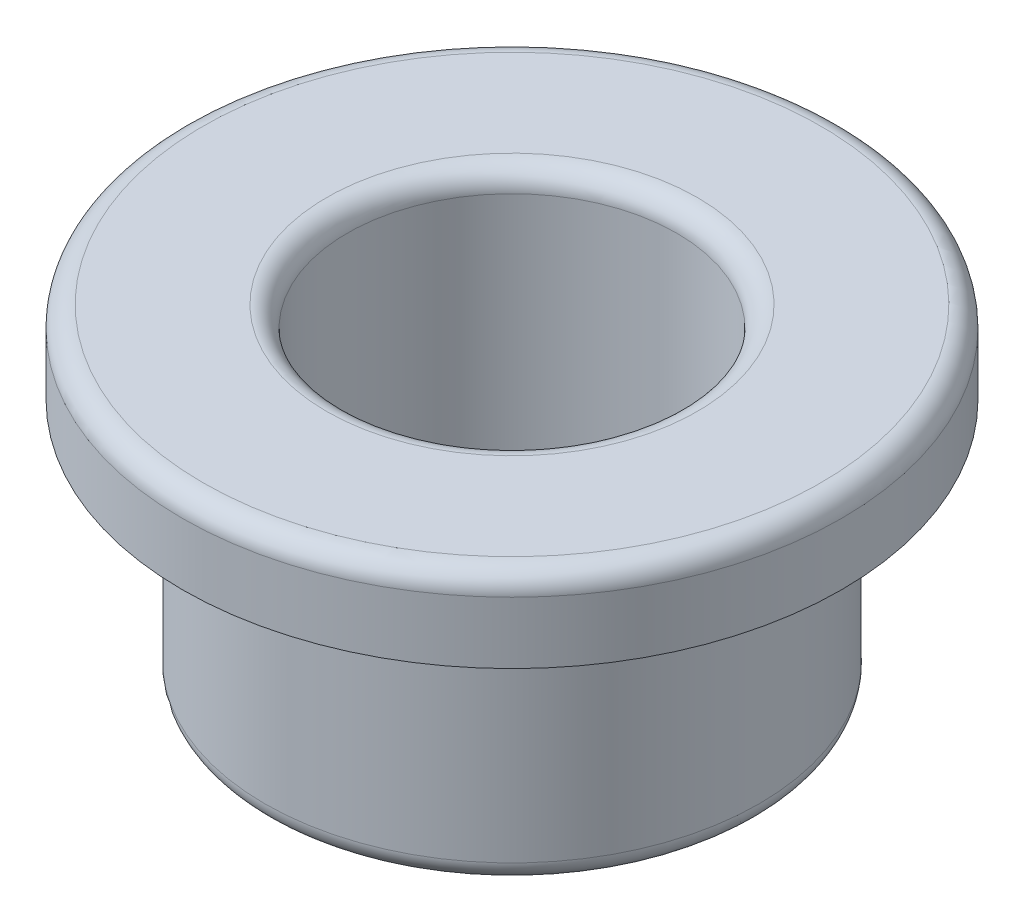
ISO-10303-21;
HEADER;
FILE_DESCRIPTION(('STEP AP214'),'2;1');
FILE_NAME('part.step','',(''),(''),'','','');
FILE_SCHEMA(('AUTOMOTIVE_DESIGN { 1 0 10303 214 1 1 1 1 }'));
ENDSEC;
DATA;
#1=APPLICATION_CONTEXT('core data for automotive mechanical design processes');
#2=APPLICATION_PROTOCOL_DEFINITION('international standard','automotive_design',2000,#1);
#3=PRODUCT_CONTEXT('',#1,'mechanical');
#4=PRODUCT('Part','Part','',(#3));
#5=PRODUCT_RELATED_PRODUCT_CATEGORY('part','',(#4));
#6=PRODUCT_DEFINITION_FORMATION('','',#4);
#7=PRODUCT_DEFINITION_CONTEXT('part definition',#1,'design');
#8=PRODUCT_DEFINITION('design','',#6,#7);
#9=PRODUCT_DEFINITION_SHAPE('','',#8);
#10=(LENGTH_UNIT() NAMED_UNIT(*) SI_UNIT(.MILLI.,.METRE.));
#11=(NAMED_UNIT(*) PLANE_ANGLE_UNIT() SI_UNIT($,.RADIAN.));
#12=(NAMED_UNIT(*) SI_UNIT($,.STERADIAN.) SOLID_ANGLE_UNIT());
#13=UNCERTAINTY_MEASURE_WITH_UNIT(LENGTH_MEASURE(1.E-05),#10,'distance_accuracy_value','');
#14=(GEOMETRIC_REPRESENTATION_CONTEXT(3) GLOBAL_UNCERTAINTY_ASSIGNED_CONTEXT((#13)) GLOBAL_UNIT_ASSIGNED_CONTEXT((#10,
#11,#12)) REPRESENTATION_CONTEXT('',''));
#15=CARTESIAN_POINT('',(0.,0.,0.));
#16=DIRECTION('',(0.,0.,1.));
#17=DIRECTION('',(1.,0.,0.));
#18=AXIS2_PLACEMENT_3D('',#15,#16,#17);
#19=CARTESIAN_POINT('',(0.,0.,0.));
#20=DIRECTION('',(0.,-1.00000000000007,0.));
#21=DIRECTION('',(0.,0.,-1.));
#22=AXIS2_PLACEMENT_3D('',#19,#20,#21);
#23=CYLINDRICAL_SURFACE('',#22,4.);
#24=CARTESIAN_POINT('',(0.,7.50000000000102,0.));
#25=DIRECTION('',(0.,1.00000000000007,0.));
#26=DIRECTION('',(0.,0.,1.));
#27=AXIS2_PLACEMENT_3D('',#24,#25,#26);
#28=CIRCLE('',#27,4.);
#29=CARTESIAN_POINT('',(0.,7.50000000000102,4.));
#30=VERTEX_POINT('',#29);
#31=EDGE_CURVE('E48',#30,#30,#28,.T.);
#32=ORIENTED_EDGE('',*,*,#31,.T.);
#33=EDGE_LOOP('',(#32));
#34=FACE_BOUND('',#33,.T.);
#35=CARTESIAN_POINT('',(0.,0.5,0.));
#36=DIRECTION('',(0.,-1.00000000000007,0.));
#37=DIRECTION('',(0.,0.,-1.));
#38=AXIS2_PLACEMENT_3D('',#35,#36,#37);
#39=CIRCLE('',#38,4.);
#40=CARTESIAN_POINT('',(0.,0.5,-4.));
#41=VERTEX_POINT('',#40);
#42=EDGE_CURVE('E51',#41,#41,#39,.T.);
#43=ORIENTED_EDGE('',*,*,#42,.T.);
#44=EDGE_LOOP('',(#43));
#45=FACE_BOUND('',#44,.T.);
#46=ADVANCED_FACE('F26',(#34,#45),#23,.F.);
#47=CARTESIAN_POINT('',(4.,8.00000000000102,0.));
#48=DIRECTION('',(0.,1.00000000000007,0.));
#49=DIRECTION('',(0.,0.,1.));
#50=AXIS2_PLACEMENT_3D('',#47,#48,#49);
#51=PLANE('',#50);
#52=CARTESIAN_POINT('',(0.,8.00000000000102,0.));
#53=DIRECTION('',(0.,1.00000000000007,0.));
#54=DIRECTION('',(0.,0.,1.));
#55=AXIS2_PLACEMENT_3D('',#52,#53,#54);
#56=CIRCLE('',#55,7.5);
#57=CARTESIAN_POINT('',(0.,8.00000000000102,7.5));
#58=VERTEX_POINT('',#57);
#59=EDGE_CURVE('E54',#58,#58,#56,.T.);
#60=ORIENTED_EDGE('',*,*,#59,.T.);
#61=EDGE_LOOP('',(#60));
#62=FACE_BOUND('',#61,.T.);
#63=CARTESIAN_POINT('',(0.,8.00000000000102,0.));
#64=DIRECTION('',(0.,1.00000000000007,0.));
#65=DIRECTION('',(0.,0.,1.));
#66=AXIS2_PLACEMENT_3D('',#63,#64,#65);
#67=CIRCLE('',#66,4.5);
#68=CARTESIAN_POINT('',(0.,8.00000000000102,4.5));
#69=VERTEX_POINT('',#68);
#70=EDGE_CURVE('E57',#69,#69,#67,.F.);
#71=ORIENTED_EDGE('',*,*,#70,.T.);
#72=EDGE_LOOP('',(#71));
#73=FACE_BOUND('',#72,.T.);
#74=ADVANCED_FACE('F71',(#62,#73),#51,.T.);
#75=CARTESIAN_POINT('',(0.,0.,0.));
#76=DIRECTION('',(0.,-1.00000000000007,0.));
#77=DIRECTION('',(0.,0.,-1.));
#78=AXIS2_PLACEMENT_3D('',#75,#76,#77);
#79=CYLINDRICAL_SURFACE('',#78,8.);
#80=CARTESIAN_POINT('',(0.,7.50000000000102,0.));
#81=DIRECTION('',(0.,1.00000000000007,0.));
#82=DIRECTION('',(0.,0.,1.));
#83=AXIS2_PLACEMENT_3D('',#80,#81,#82);
#84=CIRCLE('',#83,8.);
#85=CARTESIAN_POINT('',(0.,7.50000000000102,8.));
#86=VERTEX_POINT('',#85);
#87=EDGE_CURVE('E60',#86,#86,#84,.F.);
#88=ORIENTED_EDGE('',*,*,#87,.T.);
#89=EDGE_LOOP('',(#88));
#90=FACE_BOUND('',#89,.T.);
#91=CARTESIAN_POINT('',(0.,6.,0.));
#92=DIRECTION('',(0.,-1.00000000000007,0.));
#93=DIRECTION('',(0.,0.,-1.));
#94=AXIS2_PLACEMENT_3D('',#91,#92,#93);
#95=CIRCLE('',#94,8.);
#96=CARTESIAN_POINT('',(0.,6.,-8.));
#97=VERTEX_POINT('',#96);
#98=EDGE_CURVE('E63',#97,#97,#95,.T.);
#99=ORIENTED_EDGE('',*,*,#98,.F.);
#100=EDGE_LOOP('',(#99));
#101=FACE_BOUND('',#100,.T.);
#102=ADVANCED_FACE('F69',(#90,#101),#79,.T.);
#103=CARTESIAN_POINT('',(5.9999999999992,6.00000000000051,5.29090660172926E-13));
#104=DIRECTION('',(0.,-1.00000000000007,0.));
#105=DIRECTION('',(0.,0.,-1.));
#106=AXIS2_PLACEMENT_3D('',#103,#104,#105);
#107=PLANE('',#106);
#108=CARTESIAN_POINT('',(0.,6.,0.));
#109=DIRECTION('',(0.,-1.00000000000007,0.));
#110=DIRECTION('',(0.,0.,-1.));
#111=AXIS2_PLACEMENT_3D('',#108,#109,#110);
#112=CIRCLE('',#111,6.5);
#113=CARTESIAN_POINT('',(0.,6.,-6.5));
#114=VERTEX_POINT('',#113);
#115=EDGE_CURVE('E10',#114,#114,#112,.F.);
#116=ORIENTED_EDGE('',*,*,#115,.T.);
#117=EDGE_LOOP('',(#116));
#118=FACE_BOUND('',#117,.T.);
#119=ORIENTED_EDGE('',*,*,#98,.T.);
#120=EDGE_LOOP('',(#119));
#121=FACE_BOUND('',#120,.T.);
#122=ADVANCED_FACE('F67',(#118,#121),#107,.T.);
#123=CARTESIAN_POINT('',(0.,0.,0.));
#124=DIRECTION('',(0.,-1.00000000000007,0.));
#125=DIRECTION('',(0.,0.,-1.));
#126=AXIS2_PLACEMENT_3D('',#123,#124,#125);
#127=CYLINDRICAL_SURFACE('',#126,6.);
#128=CARTESIAN_POINT('',(0.,0.5,0.));
#129=DIRECTION('',(0.,-1.00000000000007,0.));
#130=DIRECTION('',(0.,0.,-1.));
#131=AXIS2_PLACEMENT_3D('',#128,#129,#130);
#132=CIRCLE('',#131,6.);
#133=CARTESIAN_POINT('',(0.,0.499999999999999,-6.));
#134=VERTEX_POINT('',#133);
#135=EDGE_CURVE('E32',#134,#134,#132,.F.);
#136=ORIENTED_EDGE('',*,*,#135,.T.);
#137=EDGE_LOOP('',(#136));
#138=FACE_BOUND('',#137,.T.);
#139=CARTESIAN_POINT('',(0.,5.5,0.));
#140=DIRECTION('',(0.,-1.00000000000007,0.));
#141=DIRECTION('',(0.,0.,-1.));
#142=AXIS2_PLACEMENT_3D('',#139,#140,#141);
#143=CIRCLE('',#142,6.);
#144=CARTESIAN_POINT('',(0.,5.5,-6.));
#145=VERTEX_POINT('',#144);
#146=EDGE_CURVE('E36',#145,#145,#143,.T.);
#147=ORIENTED_EDGE('',*,*,#146,.T.);
#148=EDGE_LOOP('',(#147));
#149=FACE_BOUND('',#148,.T.);
#150=ADVANCED_FACE('F78',(#138,#149),#127,.T.);
#151=CARTESIAN_POINT('',(4.,0.,0.));
#152=DIRECTION('',(0.,-1.00000000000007,0.));
#153=DIRECTION('',(0.,0.,-1.));
#154=AXIS2_PLACEMENT_3D('',#151,#152,#153);
#155=PLANE('',#154);
#156=CARTESIAN_POINT('',(0.,0.,0.));
#157=DIRECTION('',(0.,-1.00000000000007,0.));
#158=DIRECTION('',(0.,0.,-1.));
#159=AXIS2_PLACEMENT_3D('',#156,#157,#158);
#160=CIRCLE('',#159,4.5);
#161=CARTESIAN_POINT('',(0.,0.,-4.5));
#162=VERTEX_POINT('',#161);
#163=EDGE_CURVE('E40',#162,#162,#160,.F.);
#164=ORIENTED_EDGE('',*,*,#163,.T.);
#165=EDGE_LOOP('',(#164));
#166=FACE_BOUND('',#165,.T.);
#167=CARTESIAN_POINT('',(0.,0.,0.));
#168=DIRECTION('',(0.,-1.00000000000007,0.));
#169=DIRECTION('',(0.,0.,-1.));
#170=AXIS2_PLACEMENT_3D('',#167,#168,#169);
#171=CIRCLE('',#170,5.5);
#172=CARTESIAN_POINT('',(0.,0.,-5.5));
#173=VERTEX_POINT('',#172);
#174=EDGE_CURVE('E45',#173,#173,#171,.T.);
#175=ORIENTED_EDGE('',*,*,#174,.T.);
#176=EDGE_LOOP('',(#175));
#177=FACE_BOUND('',#176,.T.);
#178=ADVANCED_FACE('F110',(#166,#177),#155,.T.);
#179=CARTESIAN_POINT('',(0.,7.50000000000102,0.));
#180=DIRECTION('',(0.,1.00000000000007,0.));
#181=DIRECTION('',(0.,0.,1.));
#182=AXIS2_PLACEMENT_3D('',#179,#180,#181);
#183=TOROIDAL_SURFACE('',#182,7.5,0.5);
#184=ORIENTED_EDGE('',*,*,#59,.F.);
#185=EDGE_LOOP('',(#184));
#186=FACE_BOUND('',#185,.T.);
#187=ORIENTED_EDGE('',*,*,#87,.F.);
#188=EDGE_LOOP('',(#187));
#189=FACE_BOUND('',#188,.T.);
#190=ADVANCED_FACE('F102',(#186,#189),#183,.T.);
#191=CARTESIAN_POINT('',(0.,7.50000000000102,0.));
#192=DIRECTION('',(0.,1.00000000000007,0.));
#193=DIRECTION('',(0.,0.,1.));
#194=AXIS2_PLACEMENT_3D('',#191,#192,#193);
#195=TOROIDAL_SURFACE('',#194,4.5,0.5);
#196=ORIENTED_EDGE('',*,*,#31,.F.);
#197=EDGE_LOOP('',(#196));
#198=FACE_BOUND('',#197,.T.);
#199=ORIENTED_EDGE('',*,*,#70,.F.);
#200=EDGE_LOOP('',(#199));
#201=FACE_BOUND('',#200,.T.);
#202=ADVANCED_FACE('F92',(#198,#201),#195,.T.);
#203=CARTESIAN_POINT('',(0.,0.5,0.));
#204=DIRECTION('',(0.,-1.00000000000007,0.));
#205=DIRECTION('',(0.,0.,-1.));
#206=AXIS2_PLACEMENT_3D('',#203,#204,#205);
#207=TOROIDAL_SURFACE('',#206,4.5,0.5);
#208=ORIENTED_EDGE('',*,*,#163,.F.);
#209=EDGE_LOOP('',(#208));
#210=FACE_BOUND('',#209,.T.);
#211=ORIENTED_EDGE('',*,*,#42,.F.);
#212=EDGE_LOOP('',(#211));
#213=FACE_BOUND('',#212,.T.);
#214=ADVANCED_FACE('F89',(#210,#213),#207,.T.);
#215=CARTESIAN_POINT('',(0.,0.5,0.));
#216=DIRECTION('',(0.,-1.00000000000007,0.));
#217=DIRECTION('',(0.,0.,-1.));
#218=AXIS2_PLACEMENT_3D('',#215,#216,#217);
#219=TOROIDAL_SURFACE('',#218,5.5,0.5);
#220=ORIENTED_EDGE('',*,*,#135,.F.);
#221=EDGE_LOOP('',(#220));
#222=FACE_BOUND('',#221,.T.);
#223=ORIENTED_EDGE('',*,*,#174,.F.);
#224=EDGE_LOOP('',(#223));
#225=FACE_BOUND('',#224,.T.);
#226=ADVANCED_FACE('F91',(#222,#225),#219,.T.);
#227=CARTESIAN_POINT('',(0.,5.5,0.));
#228=DIRECTION('',(0.,-1.00000000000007,0.));
#229=DIRECTION('',(0.,0.,-1.));
#230=AXIS2_PLACEMENT_3D('',#227,#228,#229);
#231=TOROIDAL_SURFACE('',#230,6.5,0.5);
#232=ORIENTED_EDGE('',*,*,#115,.F.);
#233=EDGE_LOOP('',(#232));
#234=FACE_BOUND('',#233,.T.);
#235=ORIENTED_EDGE('',*,*,#146,.F.);
#236=EDGE_LOOP('',(#235));
#237=FACE_BOUND('',#236,.T.);
#238=ADVANCED_FACE('F99',(#234,#237),#231,.F.);
#239=CLOSED_SHELL('',(#46,#74,#102,#122,#150,#178,#190,#202,#214,#226,#238));
#240=MANIFOLD_SOLID_BREP('B2',#239);
#241=ADVANCED_BREP_SHAPE_REPRESENTATION('',(#18,#240),#14);
#242=SHAPE_DEFINITION_REPRESENTATION(#9,#241);
ENDSEC;
END-ISO-10303-21;
